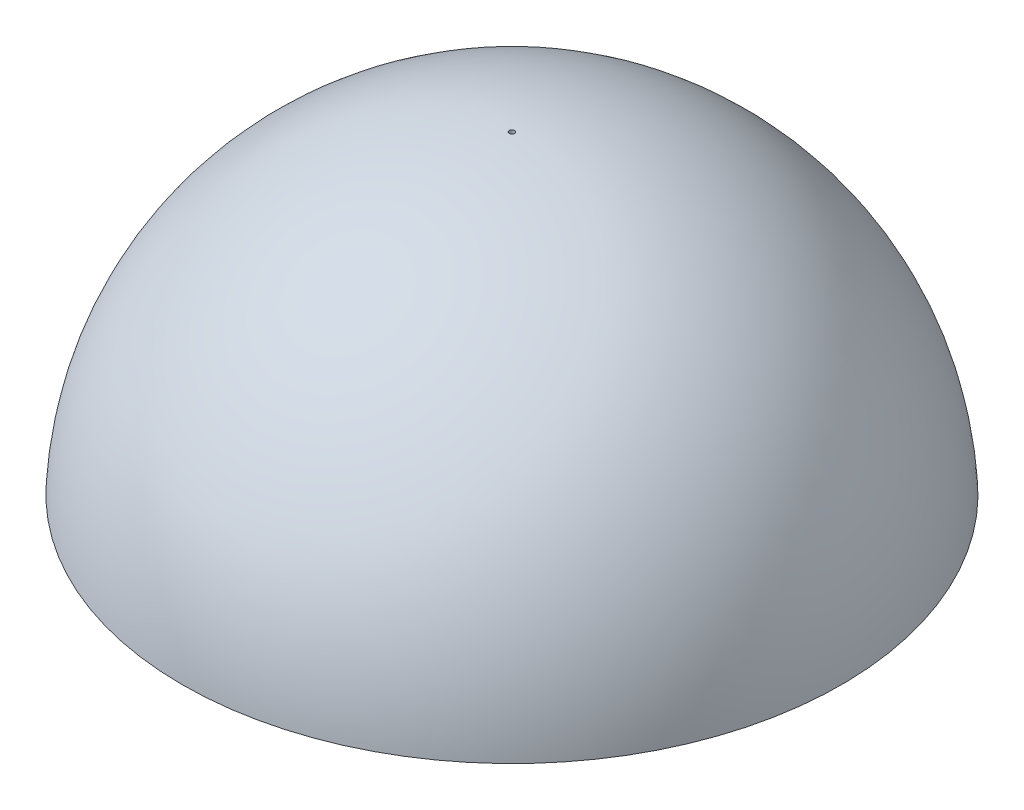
from build123d import *

# Parameters (mm, degrees)
REVOLVE1_ANGLE      = 180
SKETCH3_R           = 60
BOSS_EXTRUDE1_DEPTH = 2
SKETCH4_R           = 56
CUT_EXTRUDE4_DEPTH  = 2
SKETCH5_R           = 71.463585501
CUT_EXTRUDE5_DEPTH  = 3
SKETCH6_R           = 0.5
CUT_EXTRUDE6_DEPTH  = 108.30330843


with BuildPart() as part:
    # Sketch1 → Revolve1 (revolve)
    with BuildSketch(Plane(origin=(0, 0, 0), x_dir=(1, 0, 0), z_dir=(0, 1, 0))):
        with BuildLine():
            ThreePointArc((0, -60), (60, 0), (0, 60))
            Line((0, 60), (0, 62))
            ThreePointArc((0, 62), (62, 0), (0, -62))
            Line((0, -62), (0, -60))
        make_face()
    revolve(axis=Axis((0, 0, -62), (0, 0, 1)), revolution_arc=REVOLVE1_ANGLE)


with BuildPart() as body_2:
    # Sketch3 → Boss-Extrude1 (new body)
    with BuildSketch(Plane(origin=(0, 0, 0), x_dir=(1, 0, 0), z_dir=(0, 1, 0))):
        with Locations(Location((0, 0, 0), (0, 0, 270))):
            Circle(SKETCH3_R)
    extrude(amount=BOSS_EXTRUDE1_DEPTH)

    # Sketch4 → Cut-Extrude4 (cut)
    with BuildSketch(Plane(origin=(0, 0, 0), x_dir=(1, 0, 0), z_dir=(0, 1, 0))):
        with Locations(Location((0, 0, 0), (0, 0, 270))):
            Circle(SKETCH4_R)
    extrude(amount=CUT_EXTRUDE4_DEPTH, mode=Mode.SUBTRACT)


with BuildPart() as cut_extrude5_tool:
    # Sketch5 → Cut-Extrude5 (new body)
    with BuildSketch(Plane(origin=(0, 0, 0), x_dir=(1, 0, 0), z_dir=(0, 1, 0))):
        Circle(SKETCH5_R)
    extrude(amount=CUT_EXTRUDE5_DEPTH)


with BuildPart() as part_1:
    add(part.part)

    # Cut-Extrude5: cut by cut_extrude5_tool
    add(cut_extrude5_tool.part, mode=Mode.SUBTRACT)

    # Sketch6 → Cut-Extrude6 (cut, through all)
    with BuildSketch(Plane(origin=(0, 0, 0), x_dir=(1, 0, 0), z_dir=(0, 1, 0))):
        with Locations(Location((0, 0, 0), (0, 0, 90))):
            Circle(SKETCH6_R)
    extrude(amount=CUT_EXTRUDE6_DEPTH, mode=Mode.SUBTRACT)


with BuildPart() as body_2_1:
    add(body_2.part)

    # Cut-Extrude5: cut by cut_extrude5_tool
    add(cut_extrude5_tool.part, mode=Mode.SUBTRACT)


solid = part_1.part
